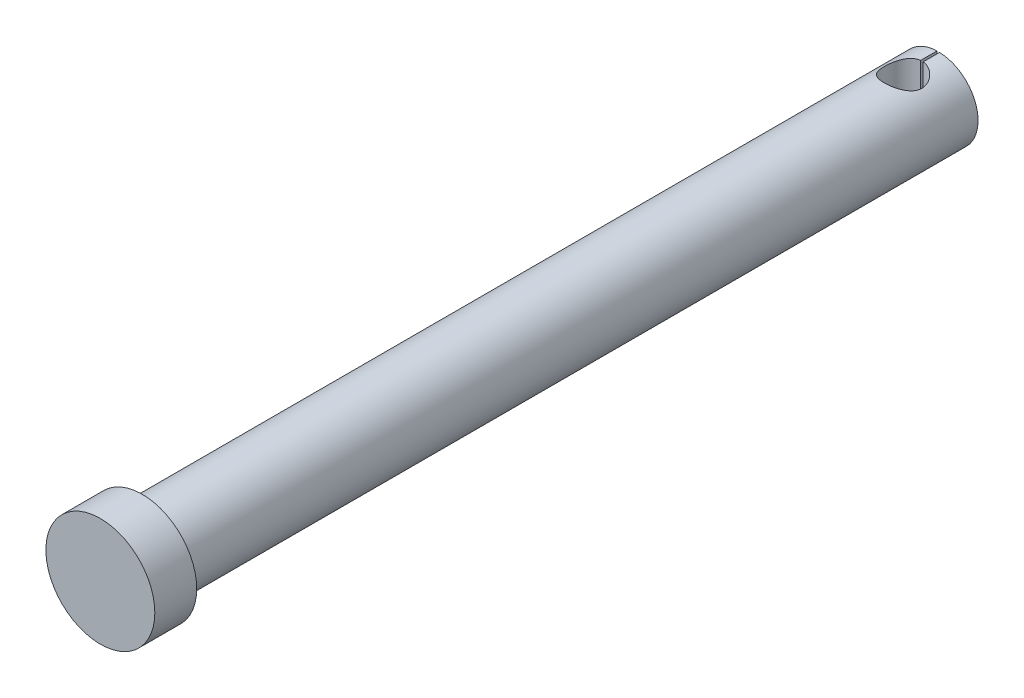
ISO-10303-21;
HEADER;
FILE_DESCRIPTION(('STEP AP214'),'2;1');
FILE_NAME('part.step','',(''),(''),'','','');
FILE_SCHEMA(('AUTOMOTIVE_DESIGN { 1 0 10303 214 1 1 1 1 }'));
ENDSEC;
DATA;
#1=APPLICATION_CONTEXT('core data for automotive mechanical design processes');
#2=APPLICATION_PROTOCOL_DEFINITION('international standard','automotive_design',2000,#1);
#3=PRODUCT_CONTEXT('',#1,'mechanical');
#4=PRODUCT('Part','Part','',(#3));
#5=PRODUCT_RELATED_PRODUCT_CATEGORY('part','',(#4));
#6=PRODUCT_DEFINITION_FORMATION('','',#4);
#7=PRODUCT_DEFINITION_CONTEXT('part definition',#1,'design');
#8=PRODUCT_DEFINITION('design','',#6,#7);
#9=PRODUCT_DEFINITION_SHAPE('','',#8);
#10=(LENGTH_UNIT() NAMED_UNIT(*) SI_UNIT(.MILLI.,.METRE.));
#11=(NAMED_UNIT(*) PLANE_ANGLE_UNIT() SI_UNIT($,.RADIAN.));
#12=(NAMED_UNIT(*) SI_UNIT($,.STERADIAN.) SOLID_ANGLE_UNIT());
#13=UNCERTAINTY_MEASURE_WITH_UNIT(LENGTH_MEASURE(1.E-05),#10,'distance_accuracy_value','');
#14=(GEOMETRIC_REPRESENTATION_CONTEXT(3) GLOBAL_UNCERTAINTY_ASSIGNED_CONTEXT((#13)) GLOBAL_UNIT_ASSIGNED_CONTEXT((#10,
#11,#12)) REPRESENTATION_CONTEXT('',''));
#15=CARTESIAN_POINT('',(0.,0.,0.));
#16=DIRECTION('',(0.,0.,1.));
#17=DIRECTION('',(1.,0.,0.));
#18=AXIS2_PLACEMENT_3D('',#15,#16,#17);
#19=CARTESIAN_POINT('',(0.,0.,0.));
#20=DIRECTION('',(0.,0.,1.));
#21=DIRECTION('',(1.,0.,0.));
#22=AXIS2_PLACEMENT_3D('',#19,#20,#21);
#23=PLANE('',#22);
#24=CARTESIAN_POINT('',(0.,0.,0.));
#25=DIRECTION('',(0.,0.,1.));
#26=DIRECTION('',(1.,0.,0.));
#27=AXIS2_PLACEMENT_3D('',#24,#25,#26);
#28=CIRCLE('',#27,4.75);
#29=CARTESIAN_POINT('',(-0.149999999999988,4.74763098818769,0.));
#30=VERTEX_POINT('',#29);
#31=CARTESIAN_POINT('',(-0.149999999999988,-4.74763098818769,0.));
#32=VERTEX_POINT('',#31);
#33=EDGE_CURVE('E141',#30,#32,#28,.T.);
#34=ORIENTED_EDGE('',*,*,#33,.F.);
#35=DIRECTION('',(0.,-1.,0.));
#36=VECTOR('',#35,1.);
#37=CARTESIAN_POINT('',(-0.15,0.,0.));
#38=LINE('',#37,#36);
#39=EDGE_CURVE('E96',#30,#32,#38,.T.);
#40=ORIENTED_EDGE('',*,*,#39,.T.);
#41=EDGE_LOOP('',(#34,#40));
#42=FACE_BOUND('',#41,.T.);
#43=ADVANCED_FACE('F39',(#42),#23,.F.);
#44=CARTESIAN_POINT('',(0.,0.,100.));
#45=DIRECTION('',(0.,0.,-1.));
#46=DIRECTION('',(-1.,0.,0.));
#47=AXIS2_PLACEMENT_3D('',#44,#45,#46);
#48=CYLINDRICAL_SURFACE('',#47,4.75);
#49=CARTESIAN_POINT('',(0.,4.75,6.45000000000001));
#50=CARTESIAN_POINT('',(-0.119017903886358,4.74999349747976,6.44999219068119));
#51=CARTESIAN_POINT('',(-0.238203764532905,4.74547734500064,6.44050017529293));
#52=CARTESIAN_POINT('',(-0.473096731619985,4.72785638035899,6.4029277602));
#53=CARTESIAN_POINT('',(-0.588795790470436,4.7147330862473,6.37480735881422));
#54=CARTESIAN_POINT('',(-0.812953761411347,4.68128193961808,6.30130049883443));
#55=CARTESIAN_POINT('',(-0.921438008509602,4.66098107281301,6.25597866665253));
#56=CARTESIAN_POINT('',(-1.12912398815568,4.6150738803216,6.149666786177));
#57=CARTESIAN_POINT('',(-1.22832709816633,4.58946834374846,6.08867906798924));
#58=CARTESIAN_POINT('',(-1.42088272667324,4.53367350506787,5.94886533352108));
#59=CARTESIAN_POINT('',(-1.51359750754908,4.50330791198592,5.86923227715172));
#60=CARTESIAN_POINT('',(-1.68493193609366,4.44204895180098,5.69611279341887));
#61=CARTESIAN_POINT('',(-1.76354201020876,4.41115524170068,5.60261703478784));
#62=CARTESIAN_POINT('',(-1.90974908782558,4.34994971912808,5.39680594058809));
#63=CARTESIAN_POINT('',(-1.976240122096,4.31981891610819,5.28364501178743));
#64=CARTESIAN_POINT('',(-2.08896735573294,4.26645432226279,5.04614466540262));
#65=CARTESIAN_POINT('',(-2.13521682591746,4.24321601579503,4.92181263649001));
#66=CARTESIAN_POINT('',(-2.20333681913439,4.2082309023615,4.67276271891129));
#67=CARTESIAN_POINT('',(-2.22644240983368,4.19590655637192,4.54846753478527));
#68=CARTESIAN_POINT('',(-2.25143411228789,4.18255522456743,4.29720263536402));
#69=CARTESIAN_POINT('',(-2.25333760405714,4.18151898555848,4.1702351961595));
#70=CARTESIAN_POINT('',(-2.23678361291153,4.19038757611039,3.93146978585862));
#71=CARTESIAN_POINT('',(-2.22043452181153,4.19915959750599,3.8194739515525));
#72=CARTESIAN_POINT('',(-2.17145365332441,4.22469452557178,3.60005766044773));
#73=CARTESIAN_POINT('',(-2.13881750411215,4.24145957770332,3.49263844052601));
#74=CARTESIAN_POINT('',(-2.05755570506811,4.2814772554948,3.28241263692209));
#75=CARTESIAN_POINT('',(-2.00857689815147,4.30487127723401,3.17977072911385));
#76=CARTESIAN_POINT('',(-1.89628129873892,4.35550299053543,2.98369568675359));
#77=CARTESIAN_POINT('',(-1.83295818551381,4.38274237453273,2.89026663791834));
#78=CARTESIAN_POINT('',(-1.68546380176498,4.44169955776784,2.70422715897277));
#79=CARTESIAN_POINT('',(-1.59975013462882,4.47357682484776,2.61288604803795));
#80=CARTESIAN_POINT('',(-1.41401954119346,4.53570685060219,2.44537902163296));
#81=CARTESIAN_POINT('',(-1.31399709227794,4.56595897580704,2.36921899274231));
#82=CARTESIAN_POINT('',(-1.09765930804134,4.62283469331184,2.23157912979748));
#83=CARTESIAN_POINT('',(-0.980871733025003,4.64927838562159,2.17076135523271));
#84=CARTESIAN_POINT('',(-0.737149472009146,4.6940830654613,2.07010373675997));
#85=CARTESIAN_POINT('',(-0.610222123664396,4.7124498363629,2.03024887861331));
#86=CARTESIAN_POINT('',(-0.360292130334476,4.73785182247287,1.97564075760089));
#87=CARTESIAN_POINT('',(-0.237737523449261,4.74564941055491,1.95919378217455));
#88=CARTESIAN_POINT('',(0.00862291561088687,4.7515873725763,1.94664261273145));
#89=CARTESIAN_POINT('',(0.132428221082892,4.74973165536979,1.95053018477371));
#90=CARTESIAN_POINT('',(0.368863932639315,4.73703656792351,1.97747096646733));
#91=CARTESIAN_POINT('',(0.481682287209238,4.72681579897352,1.99920478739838));
#92=CARTESIAN_POINT('',(0.701878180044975,4.6991687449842,2.05923044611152));
#93=CARTESIAN_POINT('',(0.809255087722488,4.68174162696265,2.09752419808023));
#94=CARTESIAN_POINT('',(1.01925290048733,4.64062767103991,2.19071575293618));
#95=CARTESIAN_POINT('',(1.12163067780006,4.61676696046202,2.24608205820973));
#96=CARTESIAN_POINT('',(1.31600171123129,4.56516902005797,2.37133306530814));
#97=CARTESIAN_POINT('',(1.40799038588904,4.53743009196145,2.44122413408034));
#98=CARTESIAN_POINT('',(1.58773308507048,4.47787396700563,2.60083782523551));
#99=CARTESIAN_POINT('',(1.67435974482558,4.44591446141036,2.69177956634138));
#100=CARTESIAN_POINT('',(1.83156994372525,4.38349418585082,2.88714669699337));
#101=CARTESIAN_POINT('',(1.90214514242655,4.35303420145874,2.99157905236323));
#102=CARTESIAN_POINT('',(2.02752646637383,4.29610955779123,3.2157740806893));
#103=CARTESIAN_POINT('',(2.08168300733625,4.2698253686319,3.3359496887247));
#104=CARTESIAN_POINT('',(2.16843471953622,4.22643846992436,3.58536866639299));
#105=CARTESIAN_POINT('',(2.20105460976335,4.20932523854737,3.71460145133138));
#106=CARTESIAN_POINT('',(2.24104512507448,4.18815976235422,3.96574717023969));
#107=CARTESIAN_POINT('',(2.25045541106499,4.1830544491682,4.08724581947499));
#108=CARTESIAN_POINT('',(2.24951105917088,4.18356384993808,4.33012584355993));
#109=CARTESIAN_POINT('',(2.23916249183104,4.18917527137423,4.45150724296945));
#110=CARTESIAN_POINT('',(2.20084739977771,4.20941507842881,4.68088319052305));
#111=CARTESIAN_POINT('',(2.17430420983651,4.22331311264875,4.78918735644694));
#112=CARTESIAN_POINT('',(2.10598530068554,4.25779068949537,4.9997409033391));
#113=CARTESIAN_POINT('',(2.0642049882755,4.27837224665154,5.10198844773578));
#114=CARTESIAN_POINT('',(1.96344011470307,4.32558534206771,5.30503147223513));
#115=CARTESIAN_POINT('',(1.90349401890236,4.35252881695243,5.40527535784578));
#116=CARTESIAN_POINT('',(1.7692506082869,4.40880366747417,5.59490673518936));
#117=CARTESIAN_POINT('',(1.69494639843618,4.43813618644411,5.68428897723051));
#118=CARTESIAN_POINT('',(1.52493436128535,4.49956176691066,5.85935739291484));
#119=CARTESIAN_POINT('',(1.42780052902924,4.53162255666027,5.94367839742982));
#120=CARTESIAN_POINT('',(1.21977637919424,4.59199166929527,6.09504892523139));
#121=CARTESIAN_POINT('',(1.10887942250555,4.62029816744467,6.16209006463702));
#122=CARTESIAN_POINT('',(0.876173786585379,4.66999592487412,6.27642008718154));
#123=CARTESIAN_POINT('',(0.754399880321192,4.69140828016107,6.32376935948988));
#124=CARTESIAN_POINT('',(0.566393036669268,4.716537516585,6.37852536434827));
#125=CARTESIAN_POINT('',(0.502883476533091,4.72374621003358,6.39406039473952));
#126=CARTESIAN_POINT('',(0.374538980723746,4.73564752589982,6.41956961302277));
#127=CARTESIAN_POINT('',(0.309704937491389,4.7403417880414,6.42954742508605));
#128=CARTESIAN_POINT('',(0.203947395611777,4.74579369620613,6.44110952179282));
#129=CARTESIAN_POINT('',(0.163247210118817,4.74736861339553,6.44444081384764));
#130=CARTESIAN_POINT('',(0.0817046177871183,4.74947289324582,6.44888741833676));
#131=CARTESIAN_POINT('',(0.040862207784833,4.75000223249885,6.45000268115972));
#132=CARTESIAN_POINT('',(0.,4.75,6.45000000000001));
#133=B_SPLINE_CURVE_WITH_KNOTS('',3,(#49,#50,#51,#52,#53,#54,#55,#56,#57,#58,#59,#60,#61,#62,
#63,#64,#65,#66,#67,#68,#69,#70,#71,#72,#73,#74,#75,#76,#77,#78,#79,#80,#81,#82,#83,#84,#85,#86,
#87,#88,#89,#90,#91,#92,#93,#94,#95,#96,#97,#98,#99,#100,#101,#102,#103,#104,#105,#106,#107,
#108,#109,#110,#111,#112,#113,#114,#115,#116,#117,#118,#119,#120,#121,#122,#123,#124,#125,#126,
#127,#128,#129,#130,#131,#132),.UNSPECIFIED.,.T.,.F.,(4,2,2,2,2,2,2,2,2,2,2,2,2,2,2,2,2,2,2,2,2,
2,2,2,2,2,2,2,2,2,2,2,2,2,2,2,2,2,2,2,2,4),(0.,0.356894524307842,0.714557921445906,
1.07089065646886,1.42717042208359,1.80338091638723,2.17984580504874,2.58179895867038,
2.98348818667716,3.36237080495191,3.74094281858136,4.07992643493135,4.41900109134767,
4.76593681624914,5.11302571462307,5.49907880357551,5.88528129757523,6.28605063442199,
6.68653253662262,7.05623667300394,7.42579111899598,7.77025059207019,8.11474989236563,
8.46970095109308,8.82480793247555,9.21189397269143,9.59918068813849,10.0002317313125,
10.400821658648,10.7647065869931,11.1284797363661,11.4641402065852,11.799901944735,
12.1580557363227,12.5163819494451,12.9121989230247,13.3082075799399,13.7029926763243,
13.9000853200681,14.0970492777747,14.2195785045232,14.3421104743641),.UNSPECIFIED.);
#134=CARTESIAN_POINT('',(0.15,4.74763098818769,1.95500556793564));
#135=VERTEX_POINT('',#134);
#136=CARTESIAN_POINT('',(-0.15,4.74763098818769,1.95500556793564));
#137=VERTEX_POINT('',#136);
#138=EDGE_CURVE('E90',#135,#137,#133,.T.);
#139=ORIENTED_EDGE('',*,*,#138,.T.);
#140=DIRECTION('',(0.,0.,-1.));
#141=VECTOR('',#140,1.);
#142=CARTESIAN_POINT('',(-0.149999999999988,4.74763098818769,100.));
#143=LINE('',#142,#141);
#144=EDGE_CURVE('E62',#137,#30,#143,.T.);
#145=ORIENTED_EDGE('',*,*,#144,.T.);
#146=ORIENTED_EDGE('',*,*,#33,.T.);
#147=DIRECTION('',(0.,0.,-1.));
#148=VECTOR('',#147,1.);
#149=CARTESIAN_POINT('',(-0.149999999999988,-4.74763098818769,100.));
#150=LINE('',#149,#148);
#151=CARTESIAN_POINT('',(-0.15,-4.74763098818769,1.95500556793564));
#152=VERTEX_POINT('',#151);
#153=EDGE_CURVE('E153',#32,#152,#150,.F.);
#154=ORIENTED_EDGE('',*,*,#153,.T.);
#155=CARTESIAN_POINT('',(0.,-4.75,6.45000000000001));
#156=CARTESIAN_POINT('',(0.119017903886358,-4.74999349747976,6.44999219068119));
#157=CARTESIAN_POINT('',(0.238203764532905,-4.74547734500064,6.44050017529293));
#158=CARTESIAN_POINT('',(0.473096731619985,-4.72785638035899,6.4029277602));
#159=CARTESIAN_POINT('',(0.588795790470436,-4.7147330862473,6.37480735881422));
#160=CARTESIAN_POINT('',(0.812953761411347,-4.68128193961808,6.30130049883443));
#161=CARTESIAN_POINT('',(0.921438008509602,-4.66098107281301,6.25597866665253));
#162=CARTESIAN_POINT('',(1.12912398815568,-4.6150738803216,6.149666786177));
#163=CARTESIAN_POINT('',(1.22832709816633,-4.58946834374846,6.08867906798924));
#164=CARTESIAN_POINT('',(1.42088272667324,-4.53367350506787,5.94886533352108));
#165=CARTESIAN_POINT('',(1.51359750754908,-4.50330791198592,5.86923227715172));
#166=CARTESIAN_POINT('',(1.68493193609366,-4.44204895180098,5.69611279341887));
#167=CARTESIAN_POINT('',(1.76354201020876,-4.41115524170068,5.60261703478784));
#168=CARTESIAN_POINT('',(1.90974908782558,-4.34994971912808,5.39680594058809));
#169=CARTESIAN_POINT('',(1.976240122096,-4.31981891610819,5.28364501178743));
#170=CARTESIAN_POINT('',(2.08896735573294,-4.26645432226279,5.04614466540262));
#171=CARTESIAN_POINT('',(2.13521682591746,-4.24321601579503,4.92181263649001));
#172=CARTESIAN_POINT('',(2.20333681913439,-4.2082309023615,4.67276271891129));
#173=CARTESIAN_POINT('',(2.22644240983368,-4.19590655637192,4.54846753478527));
#174=CARTESIAN_POINT('',(2.25143411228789,-4.18255522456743,4.29720263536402));
#175=CARTESIAN_POINT('',(2.25333760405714,-4.18151898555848,4.1702351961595));
#176=CARTESIAN_POINT('',(2.23678361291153,-4.19038757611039,3.93146978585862));
#177=CARTESIAN_POINT('',(2.22043452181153,-4.19915959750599,3.8194739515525));
#178=CARTESIAN_POINT('',(2.17145365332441,-4.22469452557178,3.60005766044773));
#179=CARTESIAN_POINT('',(2.13881750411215,-4.24145957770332,3.49263844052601));
#180=CARTESIAN_POINT('',(2.05755570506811,-4.2814772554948,3.28241263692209));
#181=CARTESIAN_POINT('',(2.00857689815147,-4.30487127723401,3.17977072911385));
#182=CARTESIAN_POINT('',(1.89628129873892,-4.35550299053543,2.98369568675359));
#183=CARTESIAN_POINT('',(1.83295818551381,-4.38274237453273,2.89026663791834));
#184=CARTESIAN_POINT('',(1.68546380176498,-4.44169955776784,2.70422715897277));
#185=CARTESIAN_POINT('',(1.59975013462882,-4.47357682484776,2.61288604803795));
#186=CARTESIAN_POINT('',(1.41401954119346,-4.53570685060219,2.44537902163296));
#187=CARTESIAN_POINT('',(1.31399709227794,-4.56595897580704,2.36921899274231));
#188=CARTESIAN_POINT('',(1.09765930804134,-4.62283469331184,2.23157912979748));
#189=CARTESIAN_POINT('',(0.980871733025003,-4.64927838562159,2.17076135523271));
#190=CARTESIAN_POINT('',(0.737149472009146,-4.6940830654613,2.07010373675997));
#191=CARTESIAN_POINT('',(0.610222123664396,-4.7124498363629,2.03024887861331));
#192=CARTESIAN_POINT('',(0.360292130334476,-4.73785182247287,1.97564075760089));
#193=CARTESIAN_POINT('',(0.237737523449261,-4.74564941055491,1.95919378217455));
#194=CARTESIAN_POINT('',(-0.00862291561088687,-4.7515873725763,1.94664261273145));
#195=CARTESIAN_POINT('',(-0.132428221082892,-4.74973165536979,1.95053018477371));
#196=CARTESIAN_POINT('',(-0.368863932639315,-4.73703656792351,1.97747096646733));
#197=CARTESIAN_POINT('',(-0.481682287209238,-4.72681579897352,1.99920478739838));
#198=CARTESIAN_POINT('',(-0.701878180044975,-4.6991687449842,2.05923044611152));
#199=CARTESIAN_POINT('',(-0.809255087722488,-4.68174162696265,2.09752419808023));
#200=CARTESIAN_POINT('',(-1.01925290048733,-4.64062767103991,2.19071575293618));
#201=CARTESIAN_POINT('',(-1.12163067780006,-4.61676696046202,2.24608205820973));
#202=CARTESIAN_POINT('',(-1.31600171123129,-4.56516902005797,2.37133306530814));
#203=CARTESIAN_POINT('',(-1.40799038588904,-4.53743009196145,2.44122413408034));
#204=CARTESIAN_POINT('',(-1.58773308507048,-4.47787396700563,2.60083782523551));
#205=CARTESIAN_POINT('',(-1.67435974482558,-4.44591446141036,2.69177956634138));
#206=CARTESIAN_POINT('',(-1.83156994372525,-4.38349418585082,2.88714669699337));
#207=CARTESIAN_POINT('',(-1.90214514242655,-4.35303420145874,2.99157905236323));
#208=CARTESIAN_POINT('',(-2.02752646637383,-4.29610955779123,3.2157740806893));
#209=CARTESIAN_POINT('',(-2.08168300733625,-4.2698253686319,3.3359496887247));
#210=CARTESIAN_POINT('',(-2.16843471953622,-4.22643846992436,3.58536866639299));
#211=CARTESIAN_POINT('',(-2.20105460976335,-4.20932523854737,3.71460145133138));
#212=CARTESIAN_POINT('',(-2.24104512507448,-4.18815976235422,3.96574717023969));
#213=CARTESIAN_POINT('',(-2.25045541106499,-4.1830544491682,4.08724581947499));
#214=CARTESIAN_POINT('',(-2.24951105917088,-4.18356384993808,4.33012584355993));
#215=CARTESIAN_POINT('',(-2.23916249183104,-4.18917527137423,4.45150724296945));
#216=CARTESIAN_POINT('',(-2.20084739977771,-4.20941507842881,4.68088319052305));
#217=CARTESIAN_POINT('',(-2.17430420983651,-4.22331311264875,4.78918735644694));
#218=CARTESIAN_POINT('',(-2.10598530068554,-4.25779068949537,4.9997409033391));
#219=CARTESIAN_POINT('',(-2.0642049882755,-4.27837224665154,5.10198844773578));
#220=CARTESIAN_POINT('',(-1.96344011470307,-4.32558534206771,5.30503147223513));
#221=CARTESIAN_POINT('',(-1.90349401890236,-4.35252881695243,5.40527535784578));
#222=CARTESIAN_POINT('',(-1.7692506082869,-4.40880366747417,5.59490673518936));
#223=CARTESIAN_POINT('',(-1.69494639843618,-4.43813618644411,5.68428897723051));
#224=CARTESIAN_POINT('',(-1.52493436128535,-4.49956176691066,5.85935739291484));
#225=CARTESIAN_POINT('',(-1.42780052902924,-4.53162255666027,5.94367839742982));
#226=CARTESIAN_POINT('',(-1.21977637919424,-4.59199166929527,6.09504892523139));
#227=CARTESIAN_POINT('',(-1.10887942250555,-4.62029816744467,6.16209006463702));
#228=CARTESIAN_POINT('',(-0.876173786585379,-4.66999592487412,6.27642008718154));
#229=CARTESIAN_POINT('',(-0.754399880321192,-4.69140828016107,6.32376935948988));
#230=CARTESIAN_POINT('',(-0.566393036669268,-4.716537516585,6.37852536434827));
#231=CARTESIAN_POINT('',(-0.502883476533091,-4.72374621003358,6.39406039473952));
#232=CARTESIAN_POINT('',(-0.374538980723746,-4.73564752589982,6.41956961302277));
#233=CARTESIAN_POINT('',(-0.309704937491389,-4.7403417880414,6.42954742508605));
#234=CARTESIAN_POINT('',(-0.203947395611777,-4.74579369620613,6.44110952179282));
#235=CARTESIAN_POINT('',(-0.163247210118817,-4.74736861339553,6.44444081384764));
#236=CARTESIAN_POINT('',(-0.0817046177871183,-4.74947289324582,6.44888741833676));
#237=CARTESIAN_POINT('',(-0.040862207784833,-4.75000223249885,6.45000268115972));
#238=CARTESIAN_POINT('',(0.,-4.75,6.45000000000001));
#239=B_SPLINE_CURVE_WITH_KNOTS('',3,(#155,#156,#157,#158,#159,#160,#161,#162,#163,#164,#165,
#166,#167,#168,#169,#170,#171,#172,#173,#174,#175,#176,#177,#178,#179,#180,#181,#182,#183,#184,
#185,#186,#187,#188,#189,#190,#191,#192,#193,#194,#195,#196,#197,#198,#199,#200,#201,#202,#203,
#204,#205,#206,#207,#208,#209,#210,#211,#212,#213,#214,#215,#216,#217,#218,#219,#220,#221,#222,
#223,#224,#225,#226,#227,#228,#229,#230,#231,#232,#233,#234,#235,#236,#237,#238),.UNSPECIFIED.,
.T.,.F.,(4,2,2,2,2,2,2,2,2,2,2,2,2,2,2,2,2,2,2,2,2,2,2,2,2,2,2,2,2,2,2,2,2,2,2,2,2,2,2,2,2,4),
(0.,0.356894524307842,0.714557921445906,1.07089065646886,1.42717042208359,1.80338091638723,
2.17984580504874,2.58179895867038,2.98348818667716,3.36237080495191,3.74094281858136,
4.07992643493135,4.41900109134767,4.76593681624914,5.11302571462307,5.49907880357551,
5.88528129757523,6.28605063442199,6.68653253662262,7.05623667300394,7.42579111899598,
7.77025059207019,8.11474989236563,8.46970095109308,8.82480793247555,9.21189397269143,
9.59918068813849,10.0002317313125,10.400821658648,10.7647065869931,11.1284797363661,
11.4641402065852,11.799901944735,12.1580557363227,12.5163819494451,12.9121989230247,
13.3082075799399,13.7029926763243,13.9000853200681,14.0970492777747,14.2195785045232,
14.3421104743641),.UNSPECIFIED.);
#240=CARTESIAN_POINT('',(0.15,-4.74763098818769,1.95500556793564));
#241=VERTEX_POINT('',#240);
#242=EDGE_CURVE('E95',#152,#241,#239,.T.);
#243=ORIENTED_EDGE('',*,*,#242,.T.);
#244=DIRECTION('',(0.,0.,-1.));
#245=VECTOR('',#244,1.);
#246=CARTESIAN_POINT('',(0.150000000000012,-4.74763098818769,100.));
#247=LINE('',#246,#245);
#248=CARTESIAN_POINT('',(0.150000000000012,-4.74763098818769,0.));
#249=VERTEX_POINT('',#248);
#250=EDGE_CURVE('E54',#241,#249,#247,.T.);
#251=ORIENTED_EDGE('',*,*,#250,.T.);
#252=CARTESIAN_POINT('',(0.150000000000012,4.74763098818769,0.));
#253=VERTEX_POINT('',#252);
#254=EDGE_CURVE('E92',#249,#253,#28,.T.);
#255=ORIENTED_EDGE('',*,*,#254,.T.);
#256=DIRECTION('',(0.,0.,-1.));
#257=VECTOR('',#256,1.);
#258=CARTESIAN_POINT('',(0.150000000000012,4.74763098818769,100.));
#259=LINE('',#258,#257);
#260=EDGE_CURVE('E78',#253,#135,#259,.F.);
#261=ORIENTED_EDGE('',*,*,#260,.T.);
#262=EDGE_LOOP('',(#139,#145,#146,#154,#243,#251,#255,#261));
#263=FACE_BOUND('',#262,.T.);
#264=CARTESIAN_POINT('',(0.,0.,94.5));
#265=DIRECTION('',(0.,0.,1.));
#266=DIRECTION('',(1.,0.,0.));
#267=AXIS2_PLACEMENT_3D('',#264,#265,#266);
#268=CIRCLE('',#267,4.75);
#269=CARTESIAN_POINT('',(4.75,0.,94.5));
#270=VERTEX_POINT('',#269);
#271=EDGE_CURVE('E84',#270,#270,#268,.F.);
#272=ORIENTED_EDGE('',*,*,#271,.T.);
#273=EDGE_LOOP('',(#272));
#274=FACE_BOUND('',#273,.T.);
#275=ADVANCED_FACE('F88',(#263,#274),#48,.T.);
#276=ORIENTED_EDGE('',*,*,#254,.F.);
#277=DIRECTION('',(0.,1.,0.));
#278=VECTOR('',#277,1.);
#279=CARTESIAN_POINT('',(0.15,0.,0.));
#280=LINE('',#279,#278);
#281=EDGE_CURVE('E155',#249,#253,#280,.T.);
#282=ORIENTED_EDGE('',*,*,#281,.T.);
#283=EDGE_LOOP('',(#276,#282));
#284=FACE_BOUND('',#283,.T.);
#285=ADVANCED_FACE('F122',(#284),#23,.F.);
#286=CARTESIAN_POINT('',(0.,0.,95.));
#287=DIRECTION('',(0.,0.,1.));
#288=DIRECTION('',(1.,0.,0.));
#289=AXIS2_PLACEMENT_3D('',#286,#287,#288);
#290=PLANE('',#289);
#291=CARTESIAN_POINT('',(0.,0.,95.));
#292=DIRECTION('',(0.,0.,1.));
#293=DIRECTION('',(1.,0.,0.));
#294=AXIS2_PLACEMENT_3D('',#291,#292,#293);
#295=CIRCLE('',#294,5.25);
#296=CARTESIAN_POINT('',(5.25,0.,95.));
#297=VERTEX_POINT('',#296);
#298=EDGE_CURVE('E143',#297,#297,#295,.T.);
#299=ORIENTED_EDGE('',*,*,#298,.T.);
#300=EDGE_LOOP('',(#299));
#301=FACE_BOUND('',#300,.T.);
#302=CARTESIAN_POINT('',(0.,0.,95.));
#303=DIRECTION('',(0.,0.,1.));
#304=DIRECTION('',(1.,0.,0.));
#305=AXIS2_PLACEMENT_3D('',#302,#303,#304);
#306=CIRCLE('',#305,6.5);
#307=CARTESIAN_POINT('',(6.5,0.,95.));
#308=VERTEX_POINT('',#307);
#309=EDGE_CURVE('E146',#308,#308,#306,.T.);
#310=ORIENTED_EDGE('',*,*,#309,.F.);
#311=EDGE_LOOP('',(#310));
#312=FACE_BOUND('',#311,.T.);
#313=ADVANCED_FACE('F117',(#301,#312),#290,.F.);
#314=CARTESIAN_POINT('',(0.,0.,95.));
#315=DIRECTION('',(0.,0.,1.));
#316=DIRECTION('',(1.,0.,0.));
#317=AXIS2_PLACEMENT_3D('',#314,#315,#316);
#318=CYLINDRICAL_SURFACE('',#317,6.5);
#319=ORIENTED_EDGE('',*,*,#309,.T.);
#320=EDGE_LOOP('',(#319));
#321=FACE_BOUND('',#320,.T.);
#322=CARTESIAN_POINT('',(0.,0.,100.));
#323=DIRECTION('',(0.,0.,1.));
#324=DIRECTION('',(1.,0.,0.));
#325=AXIS2_PLACEMENT_3D('',#322,#323,#324);
#326=CIRCLE('',#325,6.5);
#327=CARTESIAN_POINT('',(6.5,0.,100.));
#328=VERTEX_POINT('',#327);
#329=EDGE_CURVE('E98',#328,#328,#326,.T.);
#330=ORIENTED_EDGE('',*,*,#329,.F.);
#331=EDGE_LOOP('',(#330));
#332=FACE_BOUND('',#331,.T.);
#333=ADVANCED_FACE('F121',(#321,#332),#318,.T.);
#334=CARTESIAN_POINT('',(0.,0.,100.));
#335=DIRECTION('',(0.,0.,1.));
#336=DIRECTION('',(1.,0.,0.));
#337=AXIS2_PLACEMENT_3D('',#334,#335,#336);
#338=PLANE('',#337);
#339=ORIENTED_EDGE('',*,*,#329,.T.);
#340=EDGE_LOOP('',(#339));
#341=FACE_BOUND('',#340,.T.);
#342=ADVANCED_FACE('F126',(#341),#338,.T.);
#343=CARTESIAN_POINT('',(0.,0.,94.5));
#344=DIRECTION('',(0.,0.,1.));
#345=DIRECTION('',(1.,0.,0.));
#346=AXIS2_PLACEMENT_3D('',#343,#344,#345);
#347=TOROIDAL_SURFACE('',#346,5.25,0.5);
#348=ORIENTED_EDGE('',*,*,#271,.F.);
#349=EDGE_LOOP('',(#348));
#350=FACE_BOUND('',#349,.T.);
#351=ORIENTED_EDGE('',*,*,#298,.F.);
#352=EDGE_LOOP('',(#351));
#353=FACE_BOUND('',#352,.T.);
#354=ADVANCED_FACE('F41',(#350,#353),#347,.F.);
#355=CARTESIAN_POINT('',(0.,-50.,4.20000000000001));
#356=DIRECTION('',(0.,1.,0.));
#357=DIRECTION('',(0.,0.,1.));
#358=AXIS2_PLACEMENT_3D('',#355,#356,#357);
#359=CYLINDRICAL_SURFACE('',#358,2.25);
#360=ORIENTED_EDGE('',*,*,#242,.F.);
#361=DIRECTION('',(0.,1.,0.));
#362=VECTOR('',#361,1.);
#363=CARTESIAN_POINT('',(-0.15,-50.,1.95500556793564));
#364=LINE('',#363,#362);
#365=EDGE_CURVE('E11',#152,#137,#364,.T.);
#366=ORIENTED_EDGE('',*,*,#365,.T.);
#367=ORIENTED_EDGE('',*,*,#138,.F.);
#368=DIRECTION('',(0.,1.,0.));
#369=VECTOR('',#368,1.);
#370=CARTESIAN_POINT('',(0.15,-50.,1.95500556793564));
#371=LINE('',#370,#369);
#372=EDGE_CURVE('E47',#135,#241,#371,.F.);
#373=ORIENTED_EDGE('',*,*,#372,.T.);
#374=EDGE_LOOP('',(#360,#366,#367,#373));
#375=FACE_BOUND('',#374,.T.);
#376=ADVANCED_FACE('F94',(#375),#359,.F.);
#377=CARTESIAN_POINT('',(0.15,-7.5,-1.));
#378=DIRECTION('',(1.,0.,0.));
#379=DIRECTION('',(0.,0.,-1.));
#380=AXIS2_PLACEMENT_3D('',#377,#378,#379);
#381=PLANE('',#380);
#382=ORIENTED_EDGE('',*,*,#250,.F.);
#383=ORIENTED_EDGE('',*,*,#372,.F.);
#384=ORIENTED_EDGE('',*,*,#260,.F.);
#385=ORIENTED_EDGE('',*,*,#281,.F.);
#386=EDGE_LOOP('',(#382,#383,#384,#385));
#387=FACE_BOUND('',#386,.T.);
#388=ADVANCED_FACE('F77',(#387),#381,.F.);
#389=CARTESIAN_POINT('',(-0.15,-7.5,-1.));
#390=DIRECTION('',(-1.,0.,0.));
#391=DIRECTION('',(0.,0.,1.));
#392=AXIS2_PLACEMENT_3D('',#389,#390,#391);
#393=PLANE('',#392);
#394=ORIENTED_EDGE('',*,*,#144,.F.);
#395=ORIENTED_EDGE('',*,*,#365,.F.);
#396=ORIENTED_EDGE('',*,*,#153,.F.);
#397=ORIENTED_EDGE('',*,*,#39,.F.);
#398=EDGE_LOOP('',(#394,#395,#396,#397));
#399=FACE_BOUND('',#398,.T.);
#400=ADVANCED_FACE('F115',(#399),#393,.F.);
#401=CLOSED_SHELL('',(#43,#275,#285,#313,#333,#342,#354,#376,#388,#400));
#402=MANIFOLD_SOLID_BREP('B2',#401);
#403=ADVANCED_BREP_SHAPE_REPRESENTATION('',(#18,#402),#14);
#404=SHAPE_DEFINITION_REPRESENTATION(#9,#403);
ENDSEC;
END-ISO-10303-21;
